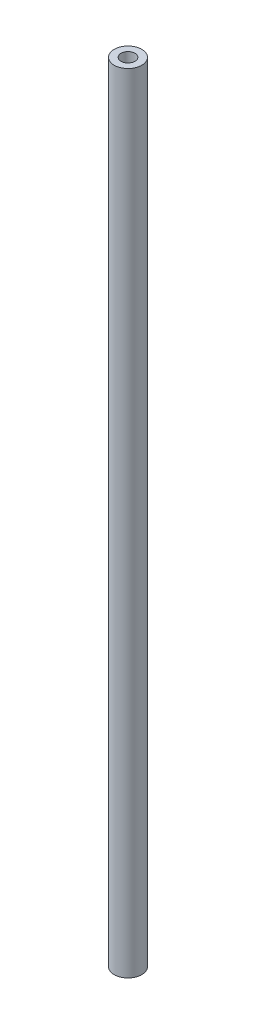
ISO-10303-21;
HEADER;
FILE_DESCRIPTION(('STEP AP214'),'2;1');
FILE_NAME('part.step','',(''),(''),'','','');
FILE_SCHEMA(('AUTOMOTIVE_DESIGN { 1 0 10303 214 1 1 1 1 }'));
ENDSEC;
DATA;
#1=APPLICATION_CONTEXT('core data for automotive mechanical design processes');
#2=APPLICATION_PROTOCOL_DEFINITION('international standard','automotive_design',2000,#1);
#3=PRODUCT_CONTEXT('',#1,'mechanical');
#4=PRODUCT('Part','Part','',(#3));
#5=PRODUCT_RELATED_PRODUCT_CATEGORY('part','',(#4));
#6=PRODUCT_DEFINITION_FORMATION('','',#4);
#7=PRODUCT_DEFINITION_CONTEXT('part definition',#1,'design');
#8=PRODUCT_DEFINITION('design','',#6,#7);
#9=PRODUCT_DEFINITION_SHAPE('','',#8);
#10=(LENGTH_UNIT() NAMED_UNIT(*) SI_UNIT(.MILLI.,.METRE.));
#11=(NAMED_UNIT(*) PLANE_ANGLE_UNIT() SI_UNIT($,.RADIAN.));
#12=(NAMED_UNIT(*) SI_UNIT($,.STERADIAN.) SOLID_ANGLE_UNIT());
#13=UNCERTAINTY_MEASURE_WITH_UNIT(LENGTH_MEASURE(1.E-05),#10,'distance_accuracy_value','');
#14=(GEOMETRIC_REPRESENTATION_CONTEXT(3) GLOBAL_UNCERTAINTY_ASSIGNED_CONTEXT((#13)) GLOBAL_UNIT_ASSIGNED_CONTEXT((#10,
#11,#12)) REPRESENTATION_CONTEXT('',''));
#15=CARTESIAN_POINT('',(0.,0.,0.));
#16=DIRECTION('',(0.,0.,1.));
#17=DIRECTION('',(1.,0.,0.));
#18=AXIS2_PLACEMENT_3D('',#15,#16,#17);
#19=CARTESIAN_POINT('',(0.,271.78,0.));
#20=DIRECTION('',(0.,1.,0.));
#21=DIRECTION('',(0.,0.,1.));
#22=AXIS2_PLACEMENT_3D('',#19,#20,#21);
#23=PLANE('',#22);
#24=CARTESIAN_POINT('',(0.,271.78,0.));
#25=DIRECTION('',(0.,1.,0.));
#26=DIRECTION('',(0.,0.,1.));
#27=AXIS2_PLACEMENT_3D('',#24,#25,#26);
#28=CIRCLE('',#27,2.413);
#29=CARTESIAN_POINT('',(0.,271.78,2.413));
#30=VERTEX_POINT('',#29);
#31=EDGE_CURVE('E79',#30,#30,#28,.T.);
#32=ORIENTED_EDGE('',*,*,#31,.F.);
#33=EDGE_LOOP('',(#32));
#34=FACE_BOUND('',#33,.T.);
#35=CARTESIAN_POINT('',(0.,271.78,0.));
#36=DIRECTION('',(0.,1.,0.));
#37=DIRECTION('',(0.,0.,1.));
#38=AXIS2_PLACEMENT_3D('',#35,#36,#37);
#39=CIRCLE('',#38,4.7625);
#40=CARTESIAN_POINT('',(0.,271.78,4.7625));
#41=VERTEX_POINT('',#40);
#42=EDGE_CURVE('E10',#41,#41,#39,.T.);
#43=ORIENTED_EDGE('',*,*,#42,.T.);
#44=EDGE_LOOP('',(#43));
#45=FACE_BOUND('',#44,.T.);
#46=ADVANCED_FACE('F33',(#34,#45),#23,.T.);
#47=CARTESIAN_POINT('',(0.,0.,0.));
#48=DIRECTION('',(0.,1.,0.));
#49=DIRECTION('',(0.,0.,1.));
#50=AXIS2_PLACEMENT_3D('',#47,#48,#49);
#51=PLANE('',#50);
#52=CARTESIAN_POINT('',(0.,0.,0.));
#53=DIRECTION('',(0.,-1.,0.));
#54=DIRECTION('',(0.,0.,-1.));
#55=AXIS2_PLACEMENT_3D('',#52,#53,#54);
#56=CIRCLE('',#55,2.413);
#57=CARTESIAN_POINT('',(0.,0.,-2.413));
#58=VERTEX_POINT('',#57);
#59=EDGE_CURVE('E64',#58,#58,#56,.T.);
#60=ORIENTED_EDGE('',*,*,#59,.F.);
#61=EDGE_LOOP('',(#60));
#62=FACE_BOUND('',#61,.T.);
#63=CARTESIAN_POINT('',(0.,0.,0.));
#64=DIRECTION('',(0.,1.,0.));
#65=DIRECTION('',(0.,0.,1.));
#66=AXIS2_PLACEMENT_3D('',#63,#64,#65);
#67=CIRCLE('',#66,4.7625);
#68=CARTESIAN_POINT('',(0.,0.,4.7625));
#69=VERTEX_POINT('',#68);
#70=EDGE_CURVE('E41',#69,#69,#67,.T.);
#71=ORIENTED_EDGE('',*,*,#70,.F.);
#72=EDGE_LOOP('',(#71));
#73=FACE_BOUND('',#72,.T.);
#74=ADVANCED_FACE('F86',(#62,#73),#51,.F.);
#75=CARTESIAN_POINT('',(0.,271.78,0.));
#76=DIRECTION('',(0.,-1.,0.));
#77=DIRECTION('',(0.,0.,-1.));
#78=AXIS2_PLACEMENT_3D('',#75,#76,#77);
#79=CYLINDRICAL_SURFACE('',#78,4.7625);
#80=ORIENTED_EDGE('',*,*,#42,.F.);
#81=EDGE_LOOP('',(#80));
#82=FACE_BOUND('',#81,.T.);
#83=ORIENTED_EDGE('',*,*,#70,.T.);
#84=EDGE_LOOP('',(#83));
#85=FACE_BOUND('',#84,.T.);
#86=ADVANCED_FACE('F35',(#82,#85),#79,.T.);
#87=CARTESIAN_POINT('',(0.,271.78,0.));
#88=DIRECTION('',(0.,-1.,0.));
#89=DIRECTION('',(0.,0.,-1.));
#90=AXIS2_PLACEMENT_3D('',#87,#88,#89);
#91=CYLINDRICAL_SURFACE('',#90,1.0795);
#92=CARTESIAN_POINT('',(0.,239.465311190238,0.));
#93=DIRECTION('',(0.,1.,0.));
#94=DIRECTION('',(0.,0.,1.));
#95=AXIS2_PLACEMENT_3D('',#92,#93,#94);
#96=CIRCLE('',#95,1.0795);
#97=CARTESIAN_POINT('',(0.,239.465311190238,1.0795));
#98=VERTEX_POINT('',#97);
#99=EDGE_CURVE('E37',#98,#98,#96,.F.);
#100=ORIENTED_EDGE('',*,*,#99,.F.);
#101=EDGE_LOOP('',(#100));
#102=FACE_BOUND('',#101,.T.);
#103=CARTESIAN_POINT('',(0.,32.3146888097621,0.));
#104=DIRECTION('',(0.,-1.,0.));
#105=DIRECTION('',(0.,0.,-1.));
#106=AXIS2_PLACEMENT_3D('',#103,#104,#105);
#107=CIRCLE('',#106,1.0795);
#108=CARTESIAN_POINT('',(0.,32.3146888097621,-1.0795));
#109=VERTEX_POINT('',#108);
#110=EDGE_CURVE('E47',#109,#109,#107,.F.);
#111=ORIENTED_EDGE('',*,*,#110,.F.);
#112=EDGE_LOOP('',(#111));
#113=FACE_BOUND('',#112,.T.);
#114=ADVANCED_FACE('F93',(#102,#113),#91,.F.);
#115=CARTESIAN_POINT('',(0.,31.75,0.));
#116=DIRECTION('',(0.,-1.,0.));
#117=DIRECTION('',(0.,0.,-1.));
#118=AXIS2_PLACEMENT_3D('',#115,#116,#117);
#119=CONICAL_SURFACE('',#118,2.01929999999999,1.02974425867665);
#120=ORIENTED_EDGE('',*,*,#110,.T.);
#121=EDGE_LOOP('',(#120));
#122=FACE_BOUND('',#121,.T.);
#123=CARTESIAN_POINT('',(0.,31.75,0.));
#124=DIRECTION('',(0.,-1.,0.));
#125=DIRECTION('',(0.,0.,-1.));
#126=AXIS2_PLACEMENT_3D('',#123,#124,#125);
#127=CIRCLE('',#126,2.01929999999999);
#128=CARTESIAN_POINT('',(0.,31.75,-2.01929999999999));
#129=VERTEX_POINT('',#128);
#130=EDGE_CURVE('E50',#129,#129,#127,.T.);
#131=ORIENTED_EDGE('',*,*,#130,.T.);
#132=EDGE_LOOP('',(#131));
#133=FACE_BOUND('',#132,.T.);
#134=ADVANCED_FACE('F96',(#122,#133),#119,.F.);
#135=CARTESIAN_POINT('',(0.,0.,0.));
#136=DIRECTION('',(0.,-1.,0.));
#137=DIRECTION('',(0.,0.,-1.));
#138=AXIS2_PLACEMENT_3D('',#135,#136,#137);
#139=CYLINDRICAL_SURFACE('',#138,2.01929999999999);
#140=ORIENTED_EDGE('',*,*,#130,.F.);
#141=EDGE_LOOP('',(#140));
#142=FACE_BOUND('',#141,.T.);
#143=CARTESIAN_POINT('',(0.,25.4,0.));
#144=DIRECTION('',(0.,-1.,0.));
#145=DIRECTION('',(0.,0.,-1.));
#146=AXIS2_PLACEMENT_3D('',#143,#144,#145);
#147=CIRCLE('',#146,2.01929999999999);
#148=CARTESIAN_POINT('',(0.,25.4,-2.01929999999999));
#149=VERTEX_POINT('',#148);
#150=EDGE_CURVE('E56',#149,#149,#147,.T.);
#151=ORIENTED_EDGE('',*,*,#150,.T.);
#152=EDGE_LOOP('',(#151));
#153=FACE_BOUND('',#152,.T.);
#154=ADVANCED_FACE('F100',(#142,#153),#139,.F.);
#155=CARTESIAN_POINT('',(2.01929999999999,25.4,0.));
#156=DIRECTION('',(0.,1.,0.));
#157=DIRECTION('',(0.,0.,1.));
#158=AXIS2_PLACEMENT_3D('',#155,#156,#157);
#159=PLANE('',#158);
#160=ORIENTED_EDGE('',*,*,#150,.F.);
#161=EDGE_LOOP('',(#160));
#162=FACE_BOUND('',#161,.T.);
#163=CARTESIAN_POINT('',(0.,25.4,0.));
#164=DIRECTION('',(0.,-1.,0.));
#165=DIRECTION('',(0.,0.,-1.));
#166=AXIS2_PLACEMENT_3D('',#163,#164,#165);
#167=CIRCLE('',#166,2.41299999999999);
#168=CARTESIAN_POINT('',(0.,25.4,-2.41299999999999));
#169=VERTEX_POINT('',#168);
#170=EDGE_CURVE('E60',#169,#169,#167,.T.);
#171=ORIENTED_EDGE('',*,*,#170,.T.);
#172=EDGE_LOOP('',(#171));
#173=FACE_BOUND('',#172,.T.);
#174=ADVANCED_FACE('F103',(#162,#173),#159,.F.);
#175=CARTESIAN_POINT('',(0.,0.,0.));
#176=DIRECTION('',(0.,-1.,0.));
#177=DIRECTION('',(0.,0.,-1.));
#178=AXIS2_PLACEMENT_3D('',#175,#176,#177);
#179=CYLINDRICAL_SURFACE('',#178,2.41299999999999);
#180=ORIENTED_EDGE('',*,*,#170,.F.);
#181=EDGE_LOOP('',(#180));
#182=FACE_BOUND('',#181,.T.);
#183=ORIENTED_EDGE('',*,*,#59,.T.);
#184=EDGE_LOOP('',(#183));
#185=FACE_BOUND('',#184,.T.);
#186=ADVANCED_FACE('F107',(#182,#185),#179,.F.);
#187=CARTESIAN_POINT('',(0.,240.03,0.));
#188=DIRECTION('',(0.,1.,0.));
#189=DIRECTION('',(0.,0.,1.));
#190=AXIS2_PLACEMENT_3D('',#187,#188,#189);
#191=CONICAL_SURFACE('',#190,2.01929999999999,1.02974425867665);
#192=ORIENTED_EDGE('',*,*,#99,.T.);
#193=EDGE_LOOP('',(#192));
#194=FACE_BOUND('',#193,.T.);
#195=CARTESIAN_POINT('',(0.,240.03,0.));
#196=DIRECTION('',(0.,1.,0.));
#197=DIRECTION('',(0.,0.,1.));
#198=AXIS2_PLACEMENT_3D('',#195,#196,#197);
#199=CIRCLE('',#198,2.01929999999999);
#200=CARTESIAN_POINT('',(0.,240.03,2.01929999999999));
#201=VERTEX_POINT('',#200);
#202=EDGE_CURVE('E70',#201,#201,#199,.T.);
#203=ORIENTED_EDGE('',*,*,#202,.T.);
#204=EDGE_LOOP('',(#203));
#205=FACE_BOUND('',#204,.T.);
#206=ADVANCED_FACE('F111',(#194,#205),#191,.F.);
#207=CARTESIAN_POINT('',(0.,271.78,0.));
#208=DIRECTION('',(0.,1.,0.));
#209=DIRECTION('',(0.,0.,1.));
#210=AXIS2_PLACEMENT_3D('',#207,#208,#209);
#211=CYLINDRICAL_SURFACE('',#210,2.01929999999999);
#212=ORIENTED_EDGE('',*,*,#202,.F.);
#213=EDGE_LOOP('',(#212));
#214=FACE_BOUND('',#213,.T.);
#215=CARTESIAN_POINT('',(0.,246.38,0.));
#216=DIRECTION('',(0.,1.,0.));
#217=DIRECTION('',(0.,0.,1.));
#218=AXIS2_PLACEMENT_3D('',#215,#216,#217);
#219=CIRCLE('',#218,2.01929999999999);
#220=CARTESIAN_POINT('',(0.,246.38,2.01929999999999));
#221=VERTEX_POINT('',#220);
#222=EDGE_CURVE('E73',#221,#221,#219,.T.);
#223=ORIENTED_EDGE('',*,*,#222,.T.);
#224=EDGE_LOOP('',(#223));
#225=FACE_BOUND('',#224,.T.);
#226=ADVANCED_FACE('F115',(#214,#225),#211,.F.);
#227=CARTESIAN_POINT('',(2.01929999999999,246.38,0.));
#228=DIRECTION('',(0.,-1.,0.));
#229=DIRECTION('',(0.,0.,-1.));
#230=AXIS2_PLACEMENT_3D('',#227,#228,#229);
#231=PLANE('',#230);
#232=ORIENTED_EDGE('',*,*,#222,.F.);
#233=EDGE_LOOP('',(#232));
#234=FACE_BOUND('',#233,.T.);
#235=CARTESIAN_POINT('',(0.,246.38,0.));
#236=DIRECTION('',(0.,1.,0.));
#237=DIRECTION('',(0.,0.,1.));
#238=AXIS2_PLACEMENT_3D('',#235,#236,#237);
#239=CIRCLE('',#238,2.413);
#240=CARTESIAN_POINT('',(0.,246.38,2.413));
#241=VERTEX_POINT('',#240);
#242=EDGE_CURVE('E76',#241,#241,#239,.T.);
#243=ORIENTED_EDGE('',*,*,#242,.T.);
#244=EDGE_LOOP('',(#243));
#245=FACE_BOUND('',#244,.T.);
#246=ADVANCED_FACE('F119',(#234,#245),#231,.F.);
#247=CARTESIAN_POINT('',(0.,271.78,0.));
#248=DIRECTION('',(0.,1.,0.));
#249=DIRECTION('',(0.,0.,1.));
#250=AXIS2_PLACEMENT_3D('',#247,#248,#249);
#251=CYLINDRICAL_SURFACE('',#250,2.413);
#252=ORIENTED_EDGE('',*,*,#242,.F.);
#253=EDGE_LOOP('',(#252));
#254=FACE_BOUND('',#253,.T.);
#255=ORIENTED_EDGE('',*,*,#31,.T.);
#256=EDGE_LOOP('',(#255));
#257=FACE_BOUND('',#256,.T.);
#258=ADVANCED_FACE('F83',(#254,#257),#251,.F.);
#259=CLOSED_SHELL('',(#46,#74,#86,#114,#134,#154,#174,#186,#206,#226,#246,#258));
#260=MANIFOLD_SOLID_BREP('B2',#259);
#261=ADVANCED_BREP_SHAPE_REPRESENTATION('',(#18,#260),#14);
#262=SHAPE_DEFINITION_REPRESENTATION(#9,#261);
ENDSEC;
END-ISO-10303-21;
